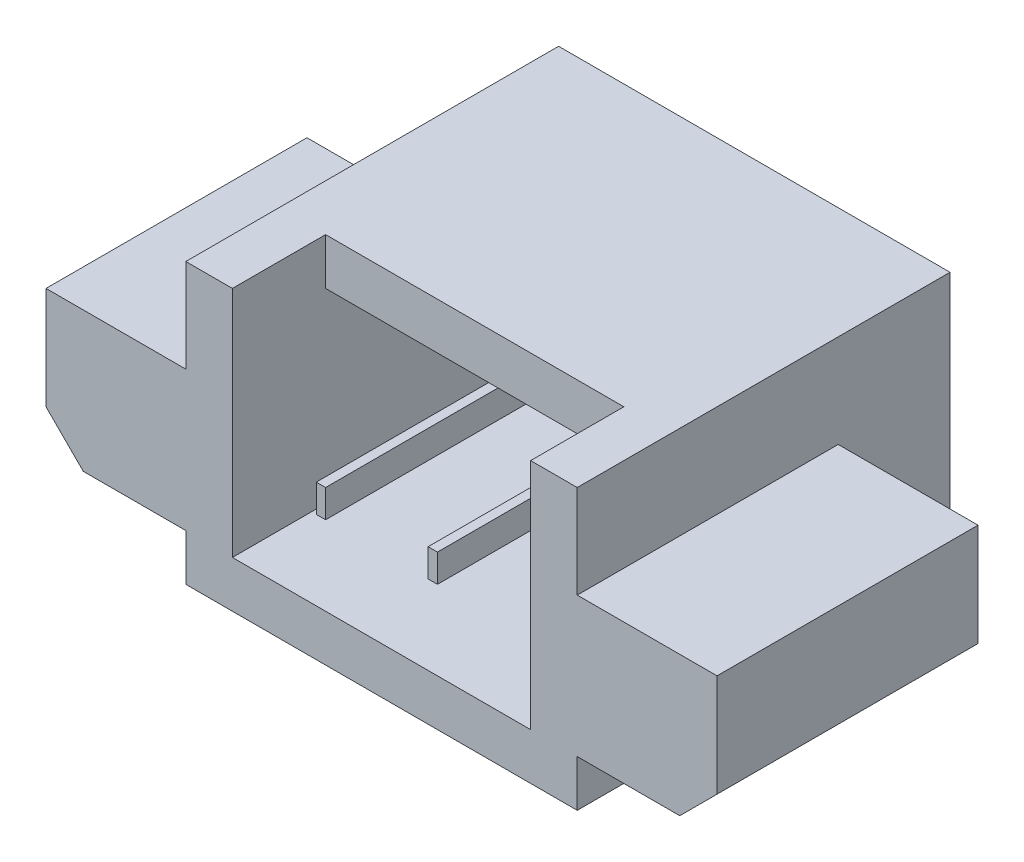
from build123d import *

# Parameters (mm, degrees)
SKETCH_1_W          = 4.2
SKETCH_1_H          = 3
SKETCH_1_W_2        = 3.2
SKETCH_1_H_2        = 2
EXTRUDE_1_DEPTH     = 4
EXTRUDE_2_DEPTH     = 2.8
SKETCH_3_W          = 4.2
SKETCH_3_H          = 3
EXTRUDE_3_DEPTH     = 0.5
SKETCH_5_W          = 3.2
SKETCH_5_H          = 1
CUT_EXTRUDE_1_DEPTH = 0.5
SKETCH_6_W          = 0.1
SKETCH_6_H          = 0.3
EXTRUDE_4_DEPTH     = 3.5


with BuildPart() as part:
    # Sketch 1 → Extrude 1 (new body)
    with BuildSketch(Plane.XY):
        Rectangle(SKETCH_1_W, SKETCH_1_H)
        Rectangle(SKETCH_1_W_2, SKETCH_1_H_2, mode=Mode.SUBTRACT)
    extrude(amount=EXTRUDE_1_DEPTH)

    # Sketch 2 → Extrude 2 (add)
    with BuildSketch(Plane.XY.offset(4)):
        Polygon((-2.1, -1), (-3.2, -1), (-3.6, -0.6), (-3.6, 0.5), (-2.1, 0.5), align=None)
        Polygon((2.1, -1), (2.1, 0.5), (3.6, 0.5), (3.6, -0.6), (3.2, -1), align=None)
    extrude(amount=-EXTRUDE_2_DEPTH)

    # Sketch 3 → Extrude 3 (add)
    with BuildSketch(Plane(origin=(0, 0, 0), x_dir=(-1, 0, 0), z_dir=(0, 0, -1))):
        Rectangle(SKETCH_3_W, SKETCH_3_H)
    extrude(amount=-EXTRUDE_3_DEPTH)

    # Sketch 5 → Cut-Extrude 1 (cut)
    with BuildSketch(Plane(origin=(0, 1.5, 0), x_dir=(1, 0, 0), z_dir=(0, 1, 0))):
        with Locations((0, -3.5)):
            Rectangle(SKETCH_5_W, SKETCH_5_H)
    extrude(amount=-CUT_EXTRUDE_1_DEPTH, mode=Mode.SUBTRACT)

    # Sketch 6 → Extrude 4 (add)
    with BuildSketch(Plane.XY.offset(0.5)):
        with Locations((0.55, 0)):
            Rectangle(SKETCH_6_W, SKETCH_6_H)
        with Locations((-0.65, 0)):
            Rectangle(SKETCH_6_W, SKETCH_6_H)
    extrude(amount=EXTRUDE_4_DEPTH)


solid = part.part
